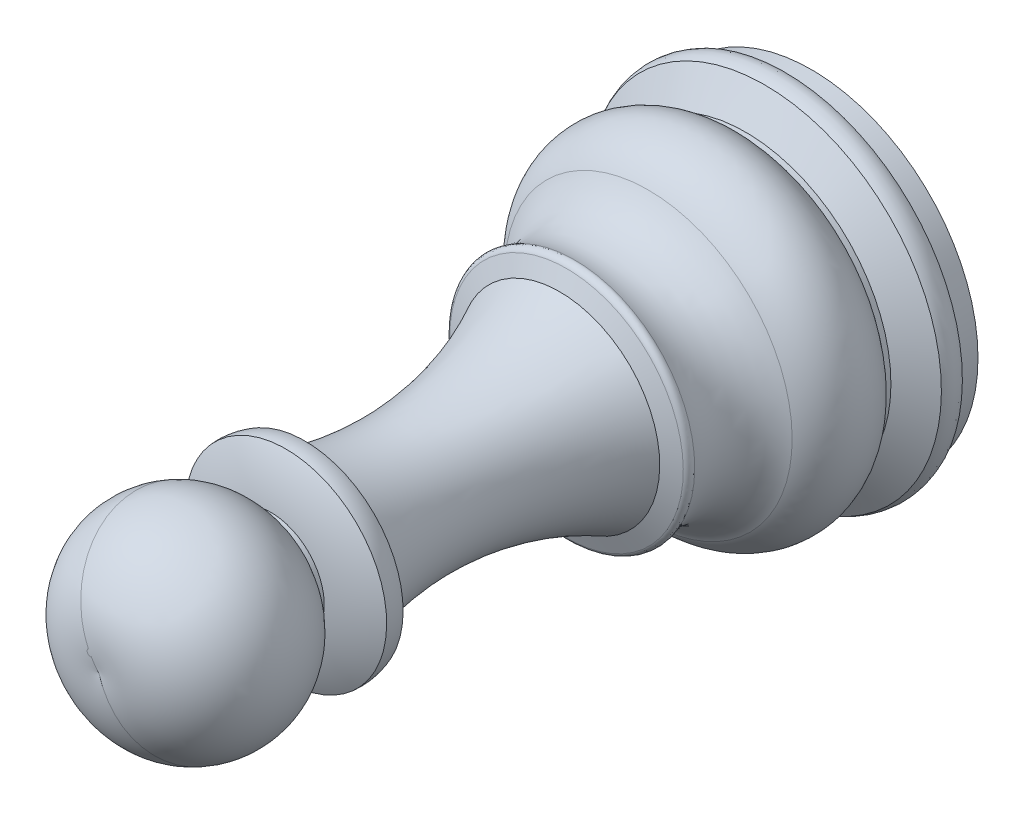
ISO-10303-21;
HEADER;
FILE_DESCRIPTION(('STEP AP214'),'2;1');
FILE_NAME('part.step','',(''),(''),'','','');
FILE_SCHEMA(('AUTOMOTIVE_DESIGN { 1 0 10303 214 1 1 1 1 }'));
ENDSEC;
DATA;
#1=APPLICATION_CONTEXT('core data for automotive mechanical design processes');
#2=APPLICATION_PROTOCOL_DEFINITION('international standard','automotive_design',2000,#1);
#3=PRODUCT_CONTEXT('',#1,'mechanical');
#4=PRODUCT('Part','Part','',(#3));
#5=PRODUCT_RELATED_PRODUCT_CATEGORY('part','',(#4));
#6=PRODUCT_DEFINITION_FORMATION('','',#4);
#7=PRODUCT_DEFINITION_CONTEXT('part definition',#1,'design');
#8=PRODUCT_DEFINITION('design','',#6,#7);
#9=PRODUCT_DEFINITION_SHAPE('','',#8);
#10=(LENGTH_UNIT() NAMED_UNIT(*) SI_UNIT(.MILLI.,.METRE.));
#11=(NAMED_UNIT(*) PLANE_ANGLE_UNIT() SI_UNIT($,.RADIAN.));
#12=(NAMED_UNIT(*) SI_UNIT($,.STERADIAN.) SOLID_ANGLE_UNIT());
#13=UNCERTAINTY_MEASURE_WITH_UNIT(LENGTH_MEASURE(1.E-05),#10,'distance_accuracy_value','');
#14=(GEOMETRIC_REPRESENTATION_CONTEXT(3) GLOBAL_UNCERTAINTY_ASSIGNED_CONTEXT((#13)) GLOBAL_UNIT_ASSIGNED_CONTEXT((#10,
#11,#12)) REPRESENTATION_CONTEXT('',''));
#15=CARTESIAN_POINT('',(0.,0.,0.));
#16=DIRECTION('',(0.,0.,1.));
#17=DIRECTION('',(1.,0.,0.));
#18=AXIS2_PLACEMENT_3D('',#15,#16,#17);
#19=CARTESIAN_POINT('',(0.,0.,1.042130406));
#20=DIRECTION('',(0.,0.,1.));
#21=DIRECTION('',(1.,0.,0.));
#22=AXIS2_PLACEMENT_3D('',#19,#20,#21);
#23=PLANE('',#22);
#24=CARTESIAN_POINT('',(0.,0.,1.0421304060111));
#25=DIRECTION('',(0.,0.,1.));
#26=DIRECTION('',(1.,0.,0.));
#27=AXIS2_PLACEMENT_3D('',#24,#25,#26);
#28=CIRCLE('',#27,6.73246072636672);
#29=CARTESIAN_POINT('',(6.73246072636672,0.,1.0421304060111));
#30=VERTEX_POINT('',#29);
#31=EDGE_CURVE('P0_E20',#30,#30,#28,.F.);
#32=ORIENTED_EDGE('',*,*,#31,.T.);
#33=EDGE_LOOP('',(#32));
#34=FACE_BOUND('',#33,.T.);
#35=ADVANCED_FACE('P0_F17',(#34),#23,.F.);
#36=CARTESIAN_POINT('',(0.,0.,1.042130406));
#37=DIRECTION('',(0.,0.,1.));
#38=DIRECTION('',(1.,0.,0.));
#39=AXIS2_PLACEMENT_3D('',#36,#37,#38);
#40=CONICAL_SURFACE('',#39,6.73246072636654,0.0163977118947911);
#41=ORIENTED_EDGE('',*,*,#31,.F.);
#42=EDGE_LOOP('',(#41));
#43=FACE_BOUND('',#42,.T.);
#44=CARTESIAN_POINT('',(0.,0.,1.84919418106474));
#45=DIRECTION('',(0.,0.,1.));
#46=DIRECTION('',(0.479425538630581,-0.877582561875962,0.));
#47=AXIS2_PLACEMENT_3D('',#44,#45,#46);
#48=CIRCLE('',#47,6.74569591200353);
#49=CARTESIAN_POINT('',(3.2340588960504,-5.91990510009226,1.84919418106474));
#50=VERTEX_POINT('',#49);
#51=EDGE_CURVE('P0_E175',#50,#50,#48,.F.);
#52=ORIENTED_EDGE('',*,*,#51,.T.);
#53=EDGE_LOOP('',(#52));
#54=FACE_BOUND('',#53,.T.);
#55=ADVANCED_FACE('P0_F183',(#43,#54),#40,.T.);
#56=CARTESIAN_POINT('',(0.,0.,1.849194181));
#57=DIRECTION('',(0.,0.,1.));
#58=DIRECTION('',(1.,0.,0.));
#59=AXIS2_PLACEMENT_3D('',#56,#57,#58);
#60=CONICAL_SURFACE('',#59,6.7456959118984,1.01883170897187);
#61=ORIENTED_EDGE('',*,*,#51,.F.);
#62=EDGE_LOOP('',(#61));
#63=FACE_BOUND('',#62,.T.);
#64=CARTESIAN_POINT('',(0.,0.,2.11001753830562));
#65=DIRECTION('',(0.,0.,1.));
#66=DIRECTION('',(0.47942553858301,-0.877582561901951,0.));
#67=AXIS2_PLACEMENT_3D('',#64,#65,#66);
#68=CIRCLE('',#67,7.16923999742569);
#69=CARTESIAN_POINT('',(3.43711674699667,-6.29160000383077,2.11001753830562));
#70=VERTEX_POINT('',#69);
#71=EDGE_CURVE('P0_E170',#70,#70,#68,.F.);
#72=ORIENTED_EDGE('',*,*,#71,.T.);
#73=EDGE_LOOP('',(#72));
#74=FACE_BOUND('',#73,.T.);
#75=ADVANCED_FACE('P0_F164',(#63,#74),#60,.T.);
#76=CARTESIAN_POINT('',(3.43711674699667,-6.29160000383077,2.11001753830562));
#77=CARTESIAN_POINT('',(3.6733071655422,-6.72394366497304,3.15481425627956));
#78=CARTESIAN_POINT('',(3.24331768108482,-5.93685319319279,3.88275983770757));
#79=CARTESIAN_POINT('',(2.80171940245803,-5.12851296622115,3.18570591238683));
#80=CARTESIAN_POINT('',(2.36012112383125,-4.32017273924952,2.4886519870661));
#81=CARTESIAN_POINT('',(2.57915717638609,-4.72111554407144,1.42772069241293));
#82=CARTESIAN_POINT('',(3.12538993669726,-5.72098790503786,1.6179630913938));
#83=(BOUNDED_CURVE() B_SPLINE_CURVE(3,(#76,#77,#78,#79,#80,#81,#82),.UNSPECIFIED.,.F.,
.F.) B_SPLINE_CURVE_WITH_KNOTS((4,3,4),(0.,0.5,1.),
.UNSPECIFIED.) CURVE() GEOMETRIC_REPRESENTATION_ITEM() RATIONAL_B_SPLINE_CURVE((1.,
0.492568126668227,0.492568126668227,1.,0.492568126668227,0.492568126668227,1.)) REPRESENTATION_ITEM(''));
#84=CARTESIAN_POINT('',(0.,0.,2.484864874));
#85=DIRECTION('',(0.,0.,1.));
#86=AXIS1_PLACEMENT('',#84,#85);
#87=SURFACE_OF_REVOLUTION('',#83,#86);
#88=ORIENTED_EDGE('',*,*,#71,.F.);
#89=EDGE_LOOP('',(#88));
#90=FACE_BOUND('',#89,.T.);
#91=CARTESIAN_POINT('',(0.,0.,2.92471433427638));
#92=DIRECTION('',(0.,0.,1.));
#93=DIRECTION('',(0.479425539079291,-0.877582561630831,0.));
#94=AXIS2_PLACEMENT_3D('',#91,#92,#93);
#95=CIRCLE('',#94,7.13520336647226);
#96=CARTESIAN_POINT('',(3.42079872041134,-6.26173004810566,2.92471433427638));
#97=VERTEX_POINT('',#96);
#98=EDGE_CURVE('P0_E146',#97,#97,#95,.F.);
#99=ORIENTED_EDGE('',*,*,#98,.T.);
#100=EDGE_LOOP('',(#99));
#101=FACE_BOUND('',#100,.T.);
#102=ADVANCED_FACE('P0_F160',(#90,#101),#87,.T.);
#103=CARTESIAN_POINT('',(2.81703470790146,-5.15654743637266,3.70546532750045));
#104=CARTESIAN_POINT('',(3.01723186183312,-5.52300586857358,3.44166822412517));
#105=CARTESIAN_POINT('',(3.21849132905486,-5.89140885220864,3.1814116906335));
#106=CARTESIAN_POINT('',(3.42079871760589,-6.26173004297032,2.92471433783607));
#107=(BOUNDED_CURVE() B_SPLINE_CURVE(3,(#103,#104,#105,#106),.UNSPECIFIED.,.F.,
.F.) B_SPLINE_CURVE_WITH_KNOTS((4,4),(0.,1.),
.UNSPECIFIED.) CURVE() GEOMETRIC_REPRESENTATION_ITEM() RATIONAL_B_SPLINE_CURVE((1.,
0.999976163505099,0.999976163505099,1.)) REPRESENTATION_ITEM(''));
#108=CARTESIAN_POINT('',(0.,0.,77.7750141));
#109=DIRECTION('',(0.,0.,1.));
#110=AXIS1_PLACEMENT('',#108,#109);
#111=SURFACE_OF_REVOLUTION('',#107,#110);
#112=ORIENTED_EDGE('',*,*,#98,.F.);
#113=EDGE_LOOP('',(#112));
#114=FACE_BOUND('',#113,.T.);
#115=CARTESIAN_POINT('',(0.,0.,3.705465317));
#116=DIRECTION('',(0.,0.,1.));
#117=DIRECTION('',(0.479425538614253,-0.877582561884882,0.));
#118=AXIS2_PLACEMENT_3D('',#115,#116,#117);
#119=CIRCLE('',#118,5.87585449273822);
#120=CARTESIAN_POINT('',(2.817034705,-5.156547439,3.705465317));
#121=VERTEX_POINT('',#120);
#122=EDGE_CURVE('P0_E143',#121,#121,#119,.F.);
#123=ORIENTED_EDGE('',*,*,#122,.T.);
#124=EDGE_LOOP('',(#123));
#125=FACE_BOUND('',#124,.T.);
#126=ADVANCED_FACE('P0_F156',(#114,#125),#111,.F.);
#127=CARTESIAN_POINT('',(0.,0.,3.705465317));
#128=DIRECTION('',(0.,0.,1.));
#129=DIRECTION('',(1.,0.,0.));
#130=AXIS2_PLACEMENT_3D('',#127,#128,#129);
#131=CYLINDRICAL_SURFACE('',#130,5.87585449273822);
#132=ORIENTED_EDGE('',*,*,#122,.F.);
#133=EDGE_LOOP('',(#132));
#134=FACE_BOUND('',#133,.T.);
#135=CARTESIAN_POINT('',(0.,0.,3.93176984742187));
#136=DIRECTION('',(0.,0.,1.));
#137=DIRECTION('',(0.479425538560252,-0.877582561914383,0.));
#138=AXIS2_PLACEMENT_3D('',#135,#136,#137);
#139=CIRCLE('',#138,5.87585449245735);
#140=CARTESIAN_POINT('',(2.81703470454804,-5.15654743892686,3.93176984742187));
#141=VERTEX_POINT('',#140);
#142=EDGE_CURVE('P0_E133',#141,#141,#139,.F.);
#143=ORIENTED_EDGE('',*,*,#142,.T.);
#144=EDGE_LOOP('',(#143));
#145=FACE_BOUND('',#144,.T.);
#146=ADVANCED_FACE('P0_F159',(#134,#145),#131,.T.);
#147=CARTESIAN_POINT('',(2.81703470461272,-5.15654743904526,3.93176984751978));
#148=CARTESIAN_POINT('',(3.62708350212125,-6.63933181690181,5.1579356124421));
#149=CARTESIAN_POINT('',(3.47942602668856,-6.36904662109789,7.22274897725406));
#150=CARTESIAN_POINT('',(2.5330854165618,-4.63678175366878,7.90246136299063));
#151=CARTESIAN_POINT('',(1.58674480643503,-2.90451688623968,8.58217374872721));
#152=CARTESIAN_POINT('',(0.860904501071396,-1.5758751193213,7.14475315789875));
#153=CARTESIAN_POINT('',(1.13727502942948,-2.08176797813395,5.13826298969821));
#154=(BOUNDED_CURVE() B_SPLINE_CURVE(3,(#147,#148,#149,#150,#151,#152,#153),.UNSPECIFIED.,.F.,
.F.) B_SPLINE_CURVE_WITH_KNOTS((4,3,4),(0.,0.5,1.),
.UNSPECIFIED.) CURVE() GEOMETRIC_REPRESENTATION_ITEM() RATIONAL_B_SPLINE_CURVE((1.,
0.641008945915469,0.641008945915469,1.,0.641008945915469,0.641008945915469,1.)) REPRESENTATION_ITEM(''));
#155=CARTESIAN_POINT('',(0.,0.,5.763057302));
#156=DIRECTION('',(0.,0.,1.));
#157=AXIS1_PLACEMENT('',#155,#156);
#158=SURFACE_OF_REVOLUTION('',#154,#157);
#159=ORIENTED_EDGE('',*,*,#142,.F.);
#160=EDGE_LOOP('',(#159));
#161=FACE_BOUND('',#160,.T.);
#162=CARTESIAN_POINT('',(0.,0.,7.63687524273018));
#163=DIRECTION('',(0.,0.,1.));
#164=DIRECTION('',(0.479425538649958,-0.877582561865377,0.));
#165=AXIS2_PLACEMENT_3D('',#162,#163,#164);
#166=CIRCLE('',#165,5.8151831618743);
#167=CARTESIAN_POINT('',(2.78794731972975,-5.10330333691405,7.63687524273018));
#168=VERTEX_POINT('',#167);
#169=EDGE_CURVE('P0_E128',#168,#168,#166,.F.);
#170=ORIENTED_EDGE('',*,*,#169,.T.);
#171=EDGE_LOOP('',(#170));
#172=FACE_BOUND('',#171,.T.);
#173=ADVANCED_FACE('P0_F120',(#161,#172),#158,.T.);
#174=CARTESIAN_POINT('',(2.32672144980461,-4.25903504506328,10.6125273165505));
#175=CARTESIAN_POINT('',(2.0932900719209,-3.83174177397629,9.46622002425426));
#176=CARTESIAN_POINT('',(2.27697022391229,-4.16796603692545,8.2811862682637));
#177=CARTESIAN_POINT('',(2.78794731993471,-5.10330333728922,7.63687524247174));
#178=(BOUNDED_CURVE() B_SPLINE_CURVE(3,(#174,#175,#176,#177),.UNSPECIFIED.,.F.,
.F.) B_SPLINE_CURVE_WITH_KNOTS((4,4),(0.,1.),
.UNSPECIFIED.) CURVE() GEOMETRIC_REPRESENTATION_ITEM() RATIONAL_B_SPLINE_CURVE((1.,
0.837009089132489,0.837009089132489,1.)) REPRESENTATION_ITEM(''));
#179=CARTESIAN_POINT('',(0.,0.,9.679423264));
#180=DIRECTION('',(0.,0.,1.));
#181=AXIS1_PLACEMENT('',#179,#180);
#182=SURFACE_OF_REVOLUTION('',#178,#181);
#183=ORIENTED_EDGE('',*,*,#169,.F.);
#184=EDGE_LOOP('',(#183));
#185=FACE_BOUND('',#184,.T.);
#186=CARTESIAN_POINT('',(0.,0.,10.612527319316));
#187=DIRECTION('',(0.,0.,1.));
#188=DIRECTION('',(0.479425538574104,-0.877582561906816,0.));
#189=AXIS2_PLACEMENT_3D('',#186,#187,#188);
#190=CIRCLE('',#189,4.85314457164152);
#191=CARTESIAN_POINT('',(2.32672145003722,-4.25903504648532,10.612527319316));
#192=VERTEX_POINT('',#191);
#193=EDGE_CURVE('P0_E104',#192,#192,#190,.F.);
#194=ORIENTED_EDGE('',*,*,#193,.T.);
#195=EDGE_LOOP('',(#194));
#196=FACE_BOUND('',#195,.T.);
#197=ADVANCED_FACE('P0_F116',(#185,#196),#182,.F.);
#198=CARTESIAN_POINT('',(2.32672144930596,-4.25903504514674,10.612527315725));
#199=CARTESIAN_POINT('',(2.35438775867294,-4.30967788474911,10.7483877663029));
#200=CARTESIAN_POINT('',(2.32756626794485,-4.26058147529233,10.88498327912));
#201=CARTESIAN_POINT('',(2.26215841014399,-4.140853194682,10.941331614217));
#202=(BOUNDED_CURVE() B_SPLINE_CURVE(3,(#198,#199,#200,#201),.UNSPECIFIED.,.F.,
.F.) B_SPLINE_CURVE_WITH_KNOTS((4,4),(0.,1.),
.UNSPECIFIED.) CURVE() GEOMETRIC_REPRESENTATION_ITEM() RATIONAL_B_SPLINE_CURVE((1.,
0.802379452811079,0.802379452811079,1.)) REPRESENTATION_ITEM(''));
#203=CARTESIAN_POINT('',(0.,0.,10.71026444));
#204=DIRECTION('',(0.,0.,1.));
#205=AXIS1_PLACEMENT('',#203,#204);
#206=SURFACE_OF_REVOLUTION('',#202,#205);
#207=ORIENTED_EDGE('',*,*,#193,.F.);
#208=EDGE_LOOP('',(#207));
#209=FACE_BOUND('',#208,.T.);
#210=CARTESIAN_POINT('',(0.,0.,10.9413316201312));
#211=DIRECTION('',(0.,0.,-1.));
#212=DIRECTION('',(-0.479425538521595,0.877582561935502,0.));
#213=AXIS2_PLACEMENT_3D('',#210,#211,#212);
#214=CIRCLE('',#213,4.71847706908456);
#215=CARTESIAN_POINT('',(-2.26215840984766,4.14085319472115,10.9413316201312));
#216=VERTEX_POINT('',#215);
#217=EDGE_CURVE('P0_E101',#216,#216,#214,.T.);
#218=ORIENTED_EDGE('',*,*,#217,.T.);
#219=EDGE_LOOP('',(#218));
#220=FACE_BOUND('',#219,.T.);
#221=ADVANCED_FACE('P0_F113',(#209,#220),#206,.T.);
#222=CARTESIAN_POINT('',(0.,0.,11.21964332));
#223=DIRECTION('',(0.,0.,-1.));
#224=DIRECTION('',(-1.,0.,0.));
#225=AXIS2_PLACEMENT_3D('',#222,#223,#224);
#226=CONICAL_SURFACE('',#225,4.04463341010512,1.17911544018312);
#227=CARTESIAN_POINT('',(0.,0.,11.2196433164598));
#228=DIRECTION('',(0.,0.,1.));
#229=DIRECTION('',(0.479425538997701,-0.877582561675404,0.));
#230=AXIS2_PLACEMENT_3D('',#227,#228,#229);
#231=CIRCLE('',#230,4.04463340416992);
#232=CARTESIAN_POINT('',(1.93910054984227,-3.54949974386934,11.2196433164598));
#233=VERTEX_POINT('',#232);
#234=EDGE_CURVE('P0_E60',#233,#233,#231,.F.);
#235=ORIENTED_EDGE('',*,*,#234,.T.);
#236=EDGE_LOOP('',(#235));
#237=FACE_BOUND('',#236,.T.);
#238=ORIENTED_EDGE('',*,*,#217,.F.);
#239=EDGE_LOOP('',(#238));
#240=FACE_BOUND('',#239,.T.);
#241=ADVANCED_FACE('P0_F89',(#237,#240),#226,.T.);
#242=CARTESIAN_POINT('',(1.52103607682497,-2.78423785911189,21.4667481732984));
#243=CARTESIAN_POINT('',(0.998183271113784,-1.82716221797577,18.0250075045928));
#244=CARTESIAN_POINT('',(1.14495076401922,-2.095818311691,14.4276152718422));
#245=CARTESIAN_POINT('',(1.93910055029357,-3.54949974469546,11.2196433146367));
#246=(BOUNDED_CURVE() B_SPLINE_CURVE(3,(#242,#243,#244,#245),.UNSPECIFIED.,.F.,
.F.) B_SPLINE_CURVE_WITH_KNOTS((4,4),(0.,1.),
.UNSPECIFIED.) CURVE() GEOMETRIC_REPRESENTATION_ITEM() RATIONAL_B_SPLINE_CURVE((1.,
0.949493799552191,0.949493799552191,1.)) REPRESENTATION_ITEM(''));
#247=CARTESIAN_POINT('',(0.,0.,17.39862594));
#248=DIRECTION('',(0.,0.,1.));
#249=AXIS1_PLACEMENT('',#247,#248);
#250=SURFACE_OF_REVOLUTION('',#246,#249);
#251=ORIENTED_EDGE('',*,*,#234,.F.);
#252=EDGE_LOOP('',(#251));
#253=FACE_BOUND('',#252,.T.);
#254=CARTESIAN_POINT('',(0.,0.,21.4667481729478));
#255=DIRECTION('',(0.,0.,1.));
#256=DIRECTION('',(-0.479425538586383,0.877582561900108,0.));
#257=AXIS2_PLACEMENT_3D('',#254,#255,#256);
#258=CIRCLE('',#257,3.17262213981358);
#259=CARTESIAN_POINT('',(1.52103607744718,-2.78423786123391,21.4667481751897));
#260=VERTEX_POINT('',#259);
#261=CARTESIAN_POINT('',(-1.52103607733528,2.7842378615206,21.4667481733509));
#262=VERTEX_POINT('',#261);
#263=EDGE_CURVE('P0_E52',#260,#262,#258,.F.);
#264=ORIENTED_EDGE('',*,*,#263,.T.);
#265=CARTESIAN_POINT('',(0.,0.,21.4667481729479));
#266=DIRECTION('',(0.,0.,1.));
#267=DIRECTION('',(0.479425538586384,-0.877582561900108,0.));
#268=AXIS2_PLACEMENT_3D('',#265,#266,#267);
#269=CIRCLE('',#268,3.17262213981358);
#270=EDGE_CURVE('P0_E58',#262,#260,#269,.F.);
#271=ORIENTED_EDGE('',*,*,#270,.T.);
#272=EDGE_LOOP('',(#264,#271));
#273=FACE_BOUND('',#272,.T.);
#274=ADVANCED_FACE('P0_F57',(#253,#273),#250,.F.);
#275=CARTESIAN_POINT('',(-1.52103607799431,2.78423786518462,21.466748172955));
#276=CARTESIAN_POINT('',(-1.64819144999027,3.01699421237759,21.4589694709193));
#277=CARTESIAN_POINT('',(-1.77517769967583,3.24944098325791,21.4747017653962));
#278=CARTESIAN_POINT('',(-1.90099759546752,3.4797527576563,21.5138215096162));
#279=(BOUNDED_CURVE() B_SPLINE_CURVE(3,(#275,#276,#277,#278),.UNSPECIFIED.,.F.,
.F.) B_SPLINE_CURVE_WITH_KNOTS((4,4),(0.,1.),
.UNSPECIFIED.) CURVE() GEOMETRIC_REPRESENTATION_ITEM() RATIONAL_B_SPLINE_CURVE((1.,
0.997382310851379,0.997382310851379,1.)) REPRESENTATION_ITEM(''));
#280=CARTESIAN_POINT('',(0.,0.,25.94876561));
#281=DIRECTION('',(0.,0.,1.));
#282=AXIS1_PLACEMENT('',#280,#281);
#283=SURFACE_OF_REVOLUTION('',#279,#282);
#284=CARTESIAN_POINT('',(-1.584057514,2.89959783,25.94876561));
#285=DIRECTION('',(-0.877582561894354,-0.479425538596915,0.));
#286=DIRECTION('',(0.479425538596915,-0.877582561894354,0.));
#287=AXIS2_PLACEMENT_3D('',#284,#285,#286);
#288=CIRCLE('',#287,4.48394468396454);
#289=CARTESIAN_POINT('',(-1.90099759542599,3.47975275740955,21.5138215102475));
#290=VERTEX_POINT('',#289);
#291=EDGE_CURVE('P0_E59',#290,#262,#288,.T.);
#292=ORIENTED_EDGE('',*,*,#291,.T.);
#293=ORIENTED_EDGE('',*,*,#263,.F.);
#294=CARTESIAN_POINT('',(1.584057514,-2.89959783,25.94876561));
#295=DIRECTION('',(-0.877582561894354,-0.479425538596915,0.));
#296=DIRECTION('',(0.479425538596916,-0.877582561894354,0.));
#297=AXIS2_PLACEMENT_3D('',#294,#295,#296);
#298=CIRCLE('',#297,4.48394468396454);
#299=CARTESIAN_POINT('',(1.90099759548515,-3.47975275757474,21.5138215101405));
#300=VERTEX_POINT('',#299);
#301=EDGE_CURVE('P0_E66',#260,#300,#298,.T.);
#302=ORIENTED_EDGE('',*,*,#301,.T.);
#303=CARTESIAN_POINT('',(0.,0.,21.5138215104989));
#304=DIRECTION('',(0.,0.,1.));
#305=DIRECTION('',(-0.479425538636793,0.877582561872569,0.));
#306=AXIS2_PLACEMENT_3D('',#303,#304,#305);
#307=CIRCLE('',#306,3.96515713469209);
#308=EDGE_CURVE('P0_E69',#300,#290,#307,.F.);
#309=ORIENTED_EDGE('',*,*,#308,.T.);
#310=EDGE_LOOP('',(#292,#293,#302,#309));
#311=FACE_BOUND('',#310,.T.);
#312=ADVANCED_FACE('P0_F68',(#311),#283,.T.);
#313=CARTESIAN_POINT('',(1.52103607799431,-2.78423786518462,21.466748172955));
#314=CARTESIAN_POINT('',(5.46490652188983,-10.0034442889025,21.225482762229));
#315=CARTESIAN_POINT('',(5.75520975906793,-10.5348408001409,29.4329553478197));
#316=CARTESIAN_POINT('',(1.83706527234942,-3.36272542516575,30.401546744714));
#317=CARTESIAN_POINT('',(-2.08107921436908,3.80938994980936,31.3701381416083));
#318=CARTESIAN_POINT('',(-2.71859875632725,4.97636164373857,23.2484997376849));
#319=CARTESIAN_POINT('',(1.14305032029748,-2.09233957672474,21.5601887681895));
#320=(BOUNDED_CURVE() B_SPLINE_CURVE(3,(#313,#314,#315,#316,#317,#318,#319),.UNSPECIFIED.,.F.,
.F.) B_SPLINE_CURVE_WITH_KNOTS((4,3,4),(0.,0.5,1.),
.UNSPECIFIED.) CURVE() GEOMETRIC_REPRESENTATION_ITEM() RATIONAL_B_SPLINE_CURVE((1.,
0.362872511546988,0.362872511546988,1.,0.362872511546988,0.362872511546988,1.)) REPRESENTATION_ITEM(''));
#321=CARTESIAN_POINT('',(0.,0.,25.94876561));
#322=DIRECTION('',(0.,0.,1.));
#323=AXIS1_PLACEMENT('',#321,#322);
#324=SURFACE_OF_REVOLUTION('',#320,#323);
#325=ORIENTED_EDGE('',*,*,#270,.F.);
#326=ORIENTED_EDGE('',*,*,#291,.F.);
#327=CARTESIAN_POINT('',(0.,0.,21.5138215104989));
#328=DIRECTION('',(0.,0.,1.));
#329=DIRECTION('',(0.479425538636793,-0.877582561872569,0.));
#330=AXIS2_PLACEMENT_3D('',#327,#328,#329);
#331=CIRCLE('',#330,3.96515713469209);
#332=EDGE_CURVE('P0_E246',#290,#300,#331,.F.);
#333=ORIENTED_EDGE('',*,*,#332,.T.);
#334=ORIENTED_EDGE('',*,*,#301,.F.);
#335=EDGE_LOOP('',(#325,#326,#333,#334));
#336=FACE_BOUND('',#335,.T.);
#337=ADVANCED_FACE('P0_F63',(#336),#324,.T.);
#338=CARTESIAN_POINT('',(1.90099759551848,-3.47975275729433,21.5138215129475));
#339=CARTESIAN_POINT('',(2.38573265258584,-4.36705432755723,24.2162739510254));
#340=CARTESIAN_POINT('',(1.15154357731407,-2.10788637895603,25.5195232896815));
#341=CARTESIAN_POINT('',(0.39429547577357,-0.721753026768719,23.1048326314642));
#342=CARTESIAN_POINT('',(-0.362952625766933,0.664380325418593,20.6901419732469));
#343=CARTESIAN_POINT('',(0.704033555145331,-1.28872477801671,18.8537209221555));
#344=CARTESIAN_POINT('',(1.69687574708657,-3.1061102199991,20.8629237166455));
#345=(BOUNDED_CURVE() B_SPLINE_CURVE(3,(#338,#339,#340,#341,#342,#343,#344),.UNSPECIFIED.,.F.,
.F.) B_SPLINE_CURVE_WITH_KNOTS((4,3,4),(0.,0.5,1.),
.UNSPECIFIED.) CURVE() GEOMETRIC_REPRESENTATION_ITEM() RATIONAL_B_SPLINE_CURVE((1.,
0.406934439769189,0.406934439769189,1.,0.40693443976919,0.40693443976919,1.)) REPRESENTATION_ITEM(''));
#346=CARTESIAN_POINT('',(0.,0.,22.1347791));
#347=DIRECTION('',(0.,0.,1.));
#348=AXIS1_PLACEMENT('',#346,#347);
#349=SURFACE_OF_REVOLUTION('',#345,#348);
#350=ORIENTED_EDGE('',*,*,#332,.F.);
#351=ORIENTED_EDGE('',*,*,#308,.F.);
#352=EDGE_LOOP('',(#350,#351));
#353=FACE_BOUND('',#352,.T.);
#354=CARTESIAN_POINT('',(0.,0.,22.2843402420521));
#355=DIRECTION('',(0.,0.,1.));
#356=DIRECTION('',(0.479425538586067,-0.87758256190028,0.));
#357=AXIS2_PLACEMENT_3D('',#354,#355,#356);
#358=CIRCLE('',#357,4.07119157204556);
#359=CARTESIAN_POINT('',(1.951833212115,-3.57280672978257,22.2843402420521));
#360=VERTEX_POINT('',#359);
#361=EDGE_CURVE('P0_E226',#360,#360,#358,.F.);
#362=ORIENTED_EDGE('',*,*,#361,.T.);
#363=EDGE_LOOP('',(#362));
#364=FACE_BOUND('',#363,.T.);
#365=ADVANCED_FACE('P0_F238',(#353,#364),#349,.T.);
#366=CARTESIAN_POINT('',(1.95183321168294,-3.57280672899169,22.2843402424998));
#367=CARTESIAN_POINT('',(1.66208260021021,-3.04242179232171,22.5845577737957));
#368=CARTESIAN_POINT('',(1.35371864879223,-2.47796536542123,22.7887507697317));
#369=CARTESIAN_POINT('',(1.034005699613,-1.89273473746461,22.8921089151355));
#370=(BOUNDED_CURVE() B_SPLINE_CURVE(3,(#366,#367,#368,#369),.UNSPECIFIED.,.F.,
.F.) B_SPLINE_CURVE_WITH_KNOTS((4,4),(0.,1.),
.UNSPECIFIED.) CURVE() GEOMETRIC_REPRESENTATION_ITEM() RATIONAL_B_SPLINE_CURVE((1.,
0.992147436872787,0.992147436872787,1.)) REPRESENTATION_ITEM(''));
#371=CARTESIAN_POINT('',(0.,0.,16.40691685));
#372=DIRECTION('',(0.,0.,1.));
#373=AXIS1_PLACEMENT('',#371,#372);
#374=SURFACE_OF_REVOLUTION('',#370,#373);
#375=ORIENTED_EDGE('',*,*,#361,.F.);
#376=EDGE_LOOP('',(#375));
#377=FACE_BOUND('',#376,.T.);
#378=CARTESIAN_POINT('',(0.,0.,22.89210892));
#379=DIRECTION('',(0.,0.,1.));
#380=DIRECTION('',(0.47942553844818,-0.877582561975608,0.));
#381=AXIS2_PLACEMENT_3D('',#378,#379,#380);
#382=CIRCLE('',#381,2.15675973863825);
#383=CARTESIAN_POINT('',(1.034005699,-1.892734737,22.89210892));
#384=VERTEX_POINT('',#383);
#385=EDGE_CURVE('P0_E223',#384,#384,#382,.F.);
#386=ORIENTED_EDGE('',*,*,#385,.T.);
#387=EDGE_LOOP('',(#386));
#388=FACE_BOUND('',#387,.T.);
#389=ADVANCED_FACE('P0_F236',(#377,#388),#374,.T.);
#390=CARTESIAN_POINT('',(0.,0.,22.89210892));
#391=DIRECTION('',(0.,0.,1.));
#392=DIRECTION('',(1.,0.,0.));
#393=AXIS2_PLACEMENT_3D('',#390,#391,#392);
#394=CYLINDRICAL_SURFACE('',#393,2.15675973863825);
#395=ORIENTED_EDGE('',*,*,#385,.F.);
#396=EDGE_LOOP('',(#395));
#397=FACE_BOUND('',#396,.T.);
#398=CARTESIAN_POINT('',(0.,0.,23.1428775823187));
#399=DIRECTION('',(0.,0.,1.));
#400=DIRECTION('',(-0.479425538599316,0.877582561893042,0.));
#401=AXIS2_PLACEMENT_3D('',#398,#399,#400);
#402=CIRCLE('',#401,2.15675973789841);
#403=CARTESIAN_POINT('',(1.03400569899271,-1.89273473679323,23.1428775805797));
#404=VERTEX_POINT('',#403);
#405=CARTESIAN_POINT('',(-1.03400569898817,1.89273473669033,23.1428775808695));
#406=VERTEX_POINT('',#405);
#407=EDGE_CURVE('P0_E34',#404,#406,#402,.F.);
#408=ORIENTED_EDGE('',*,*,#407,.T.);
#409=CARTESIAN_POINT('',(0.,0.,23.1428775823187));
#410=DIRECTION('',(0.,0.,1.));
#411=DIRECTION('',(0.479425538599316,-0.877582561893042,0.));
#412=AXIS2_PLACEMENT_3D('',#409,#410,#411);
#413=CIRCLE('',#412,2.15675973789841);
#414=EDGE_CURVE('P0_E26',#406,#404,#413,.F.);
#415=ORIENTED_EDGE('',*,*,#414,.T.);
#416=EDGE_LOOP('',(#408,#415));
#417=FACE_BOUND('',#416,.T.);
#418=ADVANCED_FACE('P0_F199',(#397,#417),#394,.T.);
#419=CARTESIAN_POINT('',(-1.03400569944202,1.89273473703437,23.1428775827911));
#420=CARTESIAN_POINT('',(-3.42249918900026,6.26484274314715,25.5396093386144));
#421=CARTESIAN_POINT('',(-2.6102512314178,4.77803282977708,30.8021374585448));
#422=CARTESIAN_POINT('',(-5.48399216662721E-11,8.80781992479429E-11,29.8421669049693));
#423=(BOUNDED_CURVE() B_SPLINE_CURVE(3,(#419,#420,#421,#422),.UNSPECIFIED.,.F.,
.F.) B_SPLINE_CURVE_WITH_KNOTS((4,4),(0.,1.),
.UNSPECIFIED.) CURVE() GEOMETRIC_REPRESENTATION_ITEM() RATIONAL_B_SPLINE_CURVE((1.,
0.424339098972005,0.424339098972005,1.)) REPRESENTATION_ITEM(''));
#424=CARTESIAN_POINT('',(0.,0.,26.34392301));
#425=DIRECTION('',(0.,0.,1.));
#426=AXIS1_PLACEMENT('',#424,#425);
#427=SURFACE_OF_REVOLUTION('',#423,#426);
#428=ORIENTED_EDGE('',*,*,#407,.F.);
#429=CARTESIAN_POINT('',(0.295711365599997,-0.541296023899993,26.34392301));
#430=DIRECTION('',(-0.877582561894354,-0.479425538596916,0.));
#431=DIRECTION('',(0.479425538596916,-0.877582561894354,0.));
#432=AXIS2_PLACEMENT_3D('',#429,#430,#431);
#433=CIRCLE('',#432,3.55220451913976);
#434=CARTESIAN_POINT('',(5.42019771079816E-13,2.95607722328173E-13,29.842166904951));
#435=VERTEX_POINT('',#434);
#436=EDGE_CURVE('P0_E11',#404,#435,#433,.T.);
#437=ORIENTED_EDGE('',*,*,#436,.T.);
#438=CARTESIAN_POINT('',(-0.295711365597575,0.541296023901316,26.34392301));
#439=DIRECTION('',(-0.877582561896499,-0.479425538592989,0.));
#440=DIRECTION('',(0.47942553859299,-0.877582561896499,0.));
#441=AXIS2_PLACEMENT_3D('',#438,#439,#440);
#442=CIRCLE('',#441,3.55220451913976);
#443=EDGE_CURVE('P0_E214',#435,#406,#442,.T.);
#444=ORIENTED_EDGE('',*,*,#443,.T.);
#445=EDGE_LOOP('',(#428,#437,#444));
#446=FACE_BOUND('',#445,.T.);
#447=ADVANCED_FACE('P0_F193',(#446),#427,.T.);
#448=CARTESIAN_POINT('',(1.03400569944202,-1.89273473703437,23.1428775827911));
#449=CARTESIAN_POINT('',(2.03382934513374,-3.72289964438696,24.146149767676));
#450=CARTESIAN_POINT('',(2.32820080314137,-4.26174298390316,26.3774496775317));
#451=CARTESIAN_POINT('',(1.71522456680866,-3.13969750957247,28.3064338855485));
#452=CARTESIAN_POINT('',(1.10224833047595,-2.01765203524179,30.2354180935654));
#453=CARTESIAN_POINT('',(0.00233590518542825,-0.00427584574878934,30.5390872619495));
#454=CARTESIAN_POINT('',(-0.830134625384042,1.51955123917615,29.0091690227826));
#455=(BOUNDED_CURVE() B_SPLINE_CURVE(3,(#448,#449,#450,#451,#452,#453,#454),.UNSPECIFIED.,.F.,
.F.) B_SPLINE_CURVE_WITH_KNOTS((4,3,4),(0.,0.5,1.),
.UNSPECIFIED.) CURVE() GEOMETRIC_REPRESENTATION_ITEM() RATIONAL_B_SPLINE_CURVE((1.,
0.771382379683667,0.771382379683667,1.,0.771382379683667,0.771382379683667,1.)) REPRESENTATION_ITEM(''));
#456=CARTESIAN_POINT('',(0.,0.,26.34392301));
#457=DIRECTION('',(0.,0.,1.));
#458=AXIS1_PLACEMENT('',#456,#457);
#459=SURFACE_OF_REVOLUTION('',#455,#458);
#460=ORIENTED_EDGE('',*,*,#414,.F.);
#461=ORIENTED_EDGE('',*,*,#443,.F.);
#462=ORIENTED_EDGE('',*,*,#436,.F.);
#463=EDGE_LOOP('',(#460,#461,#462));
#464=FACE_BOUND('',#463,.T.);
#465=ADVANCED_FACE('P0_F191',(#464),#459,.T.);
#466=CLOSED_SHELL('',(#35,#55,#75,#102,#126,#146,#173,#197,#221,#241,#274,#312,#337,#365,#389,
#418,#447,#465));
#467=MANIFOLD_SOLID_BREP('P0_B1',#466);
#468=CARTESIAN_POINT('',(0.,0.,1.542130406));
#469=DIRECTION('',(0.,0.,1.));
#470=DIRECTION('',(1.,0.,0.));
#471=AXIS2_PLACEMENT_3D('',#468,#469,#470);
#472=PLANE('',#471);
#473=CARTESIAN_POINT('',(0.,0.,1.542130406));
#474=DIRECTION('',(0.,0.,1.));
#475=DIRECTION('',(1.,0.,0.));
#476=AXIS2_PLACEMENT_3D('',#473,#474,#475);
#477=CIRCLE('',#476,6.24059308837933);
#478=CARTESIAN_POINT('',(6.24059308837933,0.,1.542130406));
#479=VERTEX_POINT('',#478);
#480=EDGE_CURVE('P1_E20',#479,#479,#477,.F.);
#481=ORIENTED_EDGE('',*,*,#480,.T.);
#482=EDGE_LOOP('',(#481));
#483=FACE_BOUND('',#482,.T.);
#484=ADVANCED_FACE('P1_F17',(#483),#472,.F.);
#485=CARTESIAN_POINT('',(0.,0.,1.542130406));
#486=DIRECTION('',(0.,0.,1.));
#487=DIRECTION('',(1.,0.,0.));
#488=AXIS2_PLACEMENT_3D('',#485,#486,#487);
#489=CONICAL_SURFACE('',#488,6.24059308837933,0.0163977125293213);
#490=ORIENTED_EDGE('',*,*,#480,.F.);
#491=EDGE_LOOP('',(#490));
#492=FACE_BOUND('',#491,.T.);
#493=CARTESIAN_POINT('',(0.,0.,2.13129771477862));
#494=DIRECTION('',(0.,0.,1.));
#495=DIRECTION('',(0.479425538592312,-0.877582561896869,0.));
#496=AXIS2_PLACEMENT_3D('',#493,#494,#495);
#497=CIRCLE('',#496,6.25025495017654);
#498=CARTESIAN_POINT('',(2.99653184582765,-5.48511475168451,2.13129771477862));
#499=VERTEX_POINT('',#498);
#500=EDGE_CURVE('P1_E100',#499,#499,#497,.F.);
#501=ORIENTED_EDGE('',*,*,#500,.T.);
#502=EDGE_LOOP('',(#501));
#503=FACE_BOUND('',#502,.T.);
#504=ADVANCED_FACE('P1_F129',(#492,#503),#489,.T.);
#505=CARTESIAN_POINT('',(0.,0.,2.131297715));
#506=DIRECTION('',(0.,0.,1.));
#507=DIRECTION('',(1.,0.,0.));
#508=AXIS2_PLACEMENT_3D('',#505,#506,#507);
#509=CONICAL_SURFACE('',#508,6.25025495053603,1.01883170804);
#510=ORIENTED_EDGE('',*,*,#500,.F.);
#511=EDGE_LOOP('',(#510));
#512=FACE_BOUND('',#511,.T.);
#513=CARTESIAN_POINT('',(0.,0.,2.43931500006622));
#514=DIRECTION('',(0.,0.,1.));
#515=DIRECTION('',(-0.479425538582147,0.877582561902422,0.));
#516=AXIS2_PLACEMENT_3D('',#513,#514,#515);
#517=CIRCLE('',#516,6.75043599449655);
#518=CARTESIAN_POINT('',(3.23633141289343,-5.9240649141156,2.4393150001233));
#519=VERTEX_POINT('',#518);
#520=CARTESIAN_POINT('',(-3.23633141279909,5.92406491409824,2.43931500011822));
#521=VERTEX_POINT('',#520);
#522=EDGE_CURVE('P1_E94',#519,#521,#517,.F.);
#523=ORIENTED_EDGE('',*,*,#522,.T.);
#524=CARTESIAN_POINT('',(0.,0.,2.43931500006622));
#525=DIRECTION('',(0.,0.,1.));
#526=DIRECTION('',(0.479425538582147,-0.877582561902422,0.));
#527=AXIS2_PLACEMENT_3D('',#524,#525,#526);
#528=CIRCLE('',#527,6.75043599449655);
#529=EDGE_CURVE('P1_E92',#521,#519,#528,.F.);
#530=ORIENTED_EDGE('',*,*,#529,.T.);
#531=EDGE_LOOP('',(#523,#530));
#532=FACE_BOUND('',#531,.T.);
#533=ADVANCED_FACE('P1_F96',(#512,#532),#509,.T.);
#534=CARTESIAN_POINT('',(-3.23633141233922,5.92406491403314,2.43931500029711));
#535=CARTESIAN_POINT('',(-3.23905783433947,5.9290555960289,2.48627762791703));
#536=CARTESIAN_POINT('',(-3.2375692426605,5.92633074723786,2.53348131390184));
#537=CARTESIAN_POINT('',(-3.23191709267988,5.91598455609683,2.57929439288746));
#538=(BOUNDED_CURVE() B_SPLINE_CURVE(3,(#534,#535,#536,#537),.UNSPECIFIED.,.F.,
.F.) B_SPLINE_CURVE_WITH_KNOTS((4,4),(0.,1.),
.UNSPECIFIED.) CURVE() GEOMETRIC_REPRESENTATION_ITEM() RATIONAL_B_SPLINE_CURVE((1.,
0.988477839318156,0.988477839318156,1.)) REPRESENTATION_ITEM(''));
#539=CARTESIAN_POINT('',(0.,0.,2.484864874));
#540=DIRECTION('',(0.,0.,1.));
#541=AXIS1_PLACEMENT('',#539,#540);
#542=SURFACE_OF_REVOLUTION('',#538,#541);
#543=CARTESIAN_POINT('',(-3.055992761,5.593957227,2.484864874));
#544=DIRECTION('',(-0.877582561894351,-0.47942553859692,0.));
#545=DIRECTION('',(0.47942553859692,-0.877582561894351,0.));
#546=AXIS2_PLACEMENT_3D('',#543,#544,#545);
#547=CIRCLE('',#546,0.378903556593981);
#548=CARTESIAN_POINT('',(-3.23191709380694,5.91598455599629,2.57929439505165));
#549=VERTEX_POINT('',#548);
#550=EDGE_CURVE('P1_E99',#549,#521,#547,.T.);
#551=ORIENTED_EDGE('',*,*,#550,.T.);
#552=ORIENTED_EDGE('',*,*,#522,.F.);
#553=CARTESIAN_POINT('',(3.055992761,-5.593957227,2.484864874));
#554=DIRECTION('',(-0.877582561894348,-0.479425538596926,0.));
#555=DIRECTION('',(0.479425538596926,-0.877582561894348,0.));
#556=AXIS2_PLACEMENT_3D('',#553,#554,#555);
#557=CIRCLE('',#556,0.378903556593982);
#558=CARTESIAN_POINT('',(3.23191709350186,-5.91598455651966,2.57929439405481));
#559=VERTEX_POINT('',#558);
#560=EDGE_CURVE('P1_E112',#519,#559,#557,.T.);
#561=ORIENTED_EDGE('',*,*,#560,.T.);
#562=CARTESIAN_POINT('',(0.,0.,2.57929439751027));
#563=DIRECTION('',(0.,0.,1.));
#564=DIRECTION('',(-0.479425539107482,0.87758256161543,0.));
#565=AXIS2_PLACEMENT_3D('',#562,#563,#564);
#566=CIRCLE('',#565,6.74122847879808);
#567=EDGE_CURVE('P1_E105',#559,#549,#566,.F.);
#568=ORIENTED_EDGE('',*,*,#567,.T.);
#569=EDGE_LOOP('',(#551,#552,#561,#568));
#570=FACE_BOUND('',#569,.T.);
#571=ADVANCED_FACE('P1_F103',(#570),#542,.T.);
#572=CARTESIAN_POINT('',(3.23633141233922,-5.92406491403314,2.43931500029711));
#573=CARTESIAN_POINT('',(3.27300032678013,-5.99118691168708,3.07093716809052));
#574=CARTESIAN_POINT('',(2.97490453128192,-5.44552621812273,3.20580687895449));
#575=CARTESIAN_POINT('',(2.88281345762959,-5.27695463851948,2.59925977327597));
#576=CARTESIAN_POINT('',(2.79072238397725,-5.10838305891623,1.99271266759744));
#577=CARTESIAN_POINT('',(3.07169654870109,-5.6227028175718,1.74507333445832));
#578=CARTESIAN_POINT('',(3.21602651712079,-5.8868970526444,2.30557917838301));
#579=(BOUNDED_CURVE() B_SPLINE_CURVE(3,(#572,#573,#574,#575,#576,#577,#578),.UNSPECIFIED.,.F.,
.F.) B_SPLINE_CURVE_WITH_KNOTS((4,3,4),(0.,0.5,1.),
.UNSPECIFIED.) CURVE() GEOMETRIC_REPRESENTATION_ITEM() RATIONAL_B_SPLINE_CURVE((1.,
0.395306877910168,0.395306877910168,1.,0.395306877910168,0.395306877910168,1.)) REPRESENTATION_ITEM(''));
#580=CARTESIAN_POINT('',(0.,0.,2.484864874));
#581=DIRECTION('',(0.,0.,1.));
#582=AXIS1_PLACEMENT('',#580,#581);
#583=SURFACE_OF_REVOLUTION('',#579,#582);
#584=ORIENTED_EDGE('',*,*,#529,.F.);
#585=ORIENTED_EDGE('',*,*,#550,.F.);
#586=CARTESIAN_POINT('',(0.,0.,2.57929439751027));
#587=DIRECTION('',(0.,0.,1.));
#588=DIRECTION('',(0.479425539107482,-0.87758256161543,0.));
#589=AXIS2_PLACEMENT_3D('',#586,#587,#588);
#590=CIRCLE('',#589,6.74122847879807);
#591=EDGE_CURVE('P1_E351',#549,#559,#590,.F.);
#592=ORIENTED_EDGE('',*,*,#591,.T.);
#593=ORIENTED_EDGE('',*,*,#560,.F.);
#594=EDGE_LOOP('',(#584,#585,#592,#593));
#595=FACE_BOUND('',#594,.T.);
#596=ADVANCED_FACE('P1_F111',(#595),#583,.T.);
#597=CARTESIAN_POINT('',(-2.57732193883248,4.71775615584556,3.43042741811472));
#598=CARTESIAN_POINT('',(-73.2170124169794,134.022842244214,-90.2971337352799));
#599=CARTESIAN_POINT('',(-118.474407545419,216.865948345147,56.6158161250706));
#600=CARTESIAN_POINT('',(-48.2479256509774,88.3172354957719,151.684720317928));
#601=CARTESIAN_POINT('',(21.9785562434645,-40.2314773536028,246.753624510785));
#602=CARTESIAN_POINT('',(67.877132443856,-124.248257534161,100.708671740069));
#603=CARTESIAN_POINT('',(-1.93028676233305,3.53336620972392,4.3063494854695));
#604=(BOUNDED_CURVE() B_SPLINE_CURVE(3,(#597,#598,#599,#600,#601,#602,#603),.UNSPECIFIED.,.F.,
.F.) B_SPLINE_CURVE_WITH_KNOTS((4,3,4),(0.,0.5,1.),
.UNSPECIFIED.) CURVE() GEOMETRIC_REPRESENTATION_ITEM() RATIONAL_B_SPLINE_CURVE((1.,
0.336376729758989,0.336376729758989,1.,0.336376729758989,0.336376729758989,1.)) REPRESENTATION_ITEM(''));
#605=CARTESIAN_POINT('',(0.,0.,77.7750141));
#606=DIRECTION('',(0.,0.,1.));
#607=AXIS1_PLACEMENT('',#605,#606);
#608=SURFACE_OF_REVOLUTION('',#604,#607);
#609=CARTESIAN_POINT('',(-25.2503857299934,46.2205210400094,77.7750141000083));
#610=DIRECTION('',(-0.877582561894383,-0.479425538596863,1.00324504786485E-13));
#611=DIRECTION('',(0.479425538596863,-0.877582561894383,0.));
#612=AXIS2_PLACEMENT_3D('',#609,#610,#611);
#613=CIRCLE('',#612,88.11166145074);
#614=CARTESIAN_POINT('',(-2.5773219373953,4.71775615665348,3.4304274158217));
#615=VERTEX_POINT('',#614);
#616=EDGE_CURVE('P1_E341',#615,#549,#613,.F.);
#617=ORIENTED_EDGE('',*,*,#616,.T.);
#618=ORIENTED_EDGE('',*,*,#567,.F.);
#619=CARTESIAN_POINT('',(25.2503857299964,-46.2205210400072,77.7750141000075));
#620=DIRECTION('',(-0.877582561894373,-0.47942553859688,0.));
#621=DIRECTION('',(0.47942553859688,-0.877582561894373,0.));
#622=AXIS2_PLACEMENT_3D('',#619,#620,#621);
#623=CIRCLE('',#622,88.1116614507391);
#624=CARTESIAN_POINT('',(2.57732193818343,-4.71775615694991,3.43042741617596));
#625=VERTEX_POINT('',#624);
#626=EDGE_CURVE('P1_E320',#559,#625,#623,.F.);
#627=ORIENTED_EDGE('',*,*,#626,.T.);
#628=CARTESIAN_POINT('',(0.,0.,3.430427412));
#629=DIRECTION('',(0.,0.,1.));
#630=DIRECTION('',(-0.479425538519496,0.877582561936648,0.));
#631=AXIS2_PLACEMENT_3D('',#628,#629,#630);
#632=CIRCLE('',#631,5.37585449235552);
#633=EDGE_CURVE('P1_E311',#625,#615,#632,.F.);
#634=ORIENTED_EDGE('',*,*,#633,.T.);
#635=EDGE_LOOP('',(#617,#618,#627,#634));
#636=FACE_BOUND('',#635,.T.);
#637=ADVANCED_FACE('P1_F331',(#636),#608,.F.);
#638=CARTESIAN_POINT('',(2.57732193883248,-4.71775615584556,3.43042741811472));
#639=CARTESIAN_POINT('',(2.79427539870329,-5.11488680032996,3.14256490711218));
#640=CARTESIAN_POINT('',(3.01247984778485,-5.51430736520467,2.85884601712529));
#641=CARTESIAN_POINT('',(3.23191709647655,-5.91598455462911,2.57929439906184));
#642=(BOUNDED_CURVE() B_SPLINE_CURVE(3,(#638,#639,#640,#641),.UNSPECIFIED.,.F.,
.F.) B_SPLINE_CURVE_WITH_KNOTS((4,4),(0.,1.),
.UNSPECIFIED.) CURVE() GEOMETRIC_REPRESENTATION_ITEM() RATIONAL_B_SPLINE_CURVE((1.,
0.999972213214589,0.999972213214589,1.)) REPRESENTATION_ITEM(''));
#643=CARTESIAN_POINT('',(0.,0.,77.7750141));
#644=DIRECTION('',(0.,0.,1.));
#645=AXIS1_PLACEMENT('',#643,#644);
#646=SURFACE_OF_REVOLUTION('',#642,#645);
#647=ORIENTED_EDGE('',*,*,#591,.F.);
#648=ORIENTED_EDGE('',*,*,#616,.F.);
#649=CARTESIAN_POINT('',(0.,0.,3.430427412));
#650=DIRECTION('',(0.,0.,1.));
#651=DIRECTION('',(0.479425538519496,-0.877582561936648,0.));
#652=AXIS2_PLACEMENT_3D('',#649,#650,#651);
#653=CIRCLE('',#652,5.37585449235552);
#654=EDGE_CURVE('P1_E303',#615,#625,#653,.F.);
#655=ORIENTED_EDGE('',*,*,#654,.T.);
#656=ORIENTED_EDGE('',*,*,#626,.F.);
#657=EDGE_LOOP('',(#647,#648,#655,#656));
#658=FACE_BOUND('',#657,.T.);
#659=ADVANCED_FACE('P1_F329',(#658),#646,.F.);
#660=CARTESIAN_POINT('',(-0.794292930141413,1.45394345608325,23.4743510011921));
#661=CARTESIAN_POINT('',(-3.19303764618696,5.84481620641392,25.2876139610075));
#662=CARTESIAN_POINT('',(-2.49877110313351,4.57396982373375,30.408610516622));
#663=CARTESIAN_POINT('',(-2.40668487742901E-11,3.17484753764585E-11,29.3331546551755));
#664=(BOUNDED_CURVE() B_SPLINE_CURVE(3,(#660,#661,#662,#663),.UNSPECIFIED.,.F.,
.F.) B_SPLINE_CURVE_WITH_KNOTS((4,4),(0.,1.),
.UNSPECIFIED.) CURVE() GEOMETRIC_REPRESENTATION_ITEM() RATIONAL_B_SPLINE_CURVE((1.,
0.38135830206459,0.38135830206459,1.)) REPRESENTATION_ITEM(''));
#665=CARTESIAN_POINT('',(0.,0.,26.34392301));
#666=DIRECTION('',(0.,0.,1.));
#667=AXIS1_PLACEMENT('',#665,#666);
#668=SURFACE_OF_REVOLUTION('',#664,#667);
#669=CARTESIAN_POINT('',(0.,0.,23.474351));
#670=DIRECTION('',(0.,0.,1.));
#671=DIRECTION('',(-0.479425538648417,0.877582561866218,0.));
#672=AXIS2_PLACEMENT_3D('',#669,#670,#671);
#673=CIRCLE('',#672,1.65675973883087);
#674=CARTESIAN_POINT('',(-0.79429293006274,1.45394345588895,23.4743510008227));
#675=VERTEX_POINT('',#674);
#676=CARTESIAN_POINT('',(0.794292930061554,-1.4539434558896,23.4743510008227));
#677=VERTEX_POINT('',#676);
#678=EDGE_CURVE('P1_E357',#675,#677,#673,.T.);
#679=ORIENTED_EDGE('',*,*,#678,.T.);
#680=CARTESIAN_POINT('',(0.295711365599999,-0.541296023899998,26.34392301));
#681=DIRECTION('',(-0.877582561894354,-0.479425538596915,0.));
#682=DIRECTION('',(0.479425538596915,-0.877582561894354,0.));
#683=AXIS2_PLACEMENT_3D('',#680,#681,#682);
#684=CIRCLE('',#683,3.05220451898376);
#685=CARTESIAN_POINT('',(-4.30455367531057E-13,-2.40204991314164E-13,29.3331546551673));
#686=VERTEX_POINT('',#685);
#687=EDGE_CURVE('P1_E305',#677,#686,#684,.T.);
#688=ORIENTED_EDGE('',*,*,#687,.T.);
#689=CARTESIAN_POINT('',(-0.295711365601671,0.541296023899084,26.34392301));
#690=DIRECTION('',(-0.877582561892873,-0.479425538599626,0.));
#691=DIRECTION('',(0.479425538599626,-0.877582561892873,0.));
#692=AXIS2_PLACEMENT_3D('',#689,#690,#691);
#693=CIRCLE('',#692,3.05220451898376);
#694=EDGE_CURVE('P1_E310',#686,#675,#693,.T.);
#695=ORIENTED_EDGE('',*,*,#694,.T.);
#696=EDGE_LOOP('',(#679,#688,#695));
#697=FACE_BOUND('',#696,.T.);
#698=ADVANCED_FACE('P1_F294',(#697),#668,.T.);
#699=CARTESIAN_POINT('',(0.794292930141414,-1.45394345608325,23.4743510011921));
#700=CARTESIAN_POINT('',(1.64703740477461,-3.01488174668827,24.1189589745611));
#701=CARTESIAN_POINT('',(2.00163479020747,-3.66396790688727,25.8602713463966));
#702=CARTESIAN_POINT('',(1.63196663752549,-2.98729489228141,27.5878939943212));
#703=CARTESIAN_POINT('',(1.2622984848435,-2.31062187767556,29.3155166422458));
#704=CARTESIAN_POINT('',(0.4040935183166,-0.739688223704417,29.9277850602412));
#705=CARTESIAN_POINT('',(-0.395391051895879,0.723758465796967,29.0342700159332));
#706=(BOUNDED_CURVE() B_SPLINE_CURVE(3,(#699,#700,#701,#702,#703,#704,#705),.UNSPECIFIED.,.F.,
.F.) B_SPLINE_CURVE_WITH_KNOTS((4,3,4),(0.,0.5,1.),
.UNSPECIFIED.) CURVE() GEOMETRIC_REPRESENTATION_ITEM() RATIONAL_B_SPLINE_CURVE((1.,
0.787441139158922,0.787441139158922,1.,0.787441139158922,0.787441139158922,1.)) REPRESENTATION_ITEM(''));
#707=CARTESIAN_POINT('',(0.,0.,26.34392301));
#708=DIRECTION('',(0.,0.,1.));
#709=AXIS1_PLACEMENT('',#707,#708);
#710=SURFACE_OF_REVOLUTION('',#706,#709);
#711=CARTESIAN_POINT('',(0.,0.,23.474351));
#712=DIRECTION('',(0.,0.,1.));
#713=DIRECTION('',(0.479425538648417,-0.877582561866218,0.));
#714=AXIS2_PLACEMENT_3D('',#711,#712,#713);
#715=CIRCLE('',#714,1.65675973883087);
#716=EDGE_CURVE('P1_E361',#677,#675,#715,.T.);
#717=ORIENTED_EDGE('',*,*,#716,.T.);
#718=ORIENTED_EDGE('',*,*,#694,.F.);
#719=ORIENTED_EDGE('',*,*,#687,.F.);
#720=EDGE_LOOP('',(#717,#718,#719));
#721=FACE_BOUND('',#720,.T.);
#722=ADVANCED_FACE('P1_F289',(#721),#710,.T.);
#723=CARTESIAN_POINT('',(0.,0.,3.430427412));
#724=DIRECTION('',(0.,0.,1.));
#725=DIRECTION('',(1.,0.,0.));
#726=AXIS2_PLACEMENT_3D('',#723,#724,#725);
#727=CYLINDRICAL_SURFACE('',#726,5.37585449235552);
#728=ORIENTED_EDGE('',*,*,#654,.F.);
#729=ORIENTED_EDGE('',*,*,#633,.F.);
#730=EDGE_LOOP('',(#728,#729));
#731=FACE_BOUND('',#730,.T.);
#732=CARTESIAN_POINT('',(0.,0.,4.20745696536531));
#733=DIRECTION('',(0.,0.,1.));
#734=DIRECTION('',(0.479425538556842,-0.877582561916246,0.));
#735=AXIS2_PLACEMENT_3D('',#732,#733,#734);
#736=CIRCLE('',#735,5.37585449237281);
#737=CARTESIAN_POINT('',(2.57732193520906,-4.71775615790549,4.20745696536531));
#738=VERTEX_POINT('',#737);
#739=EDGE_CURVE('P1_E269',#738,#738,#736,.F.);
#740=ORIENTED_EDGE('',*,*,#739,.T.);
#741=EDGE_LOOP('',(#740));
#742=FACE_BOUND('',#741,.T.);
#743=ADVANCED_FACE('P1_F285',(#731,#742),#727,.T.);
#744=CARTESIAN_POINT('',(0.,0.,22.44845943));
#745=DIRECTION('',(0.,0.,1.));
#746=DIRECTION('',(1.,0.,0.));
#747=AXIS2_PLACEMENT_3D('',#744,#745,#746);
#748=CYLINDRICAL_SURFACE('',#747,1.65675973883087);
#749=CARTESIAN_POINT('',(0.,0.,22.4484594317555));
#750=DIRECTION('',(0.,0.,1.));
#751=DIRECTION('',(0.479425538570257,-0.877582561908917,0.));
#752=AXIS2_PLACEMENT_3D('',#749,#750,#751);
#753=CIRCLE('',#752,1.65675973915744);
#754=CARTESIAN_POINT('',(0.79429293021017,-1.45394345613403,22.4484594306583));
#755=VERTEX_POINT('',#754);
#756=CARTESIAN_POINT('',(-0.794292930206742,1.45394345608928,22.4484594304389));
#757=VERTEX_POINT('',#756);
#758=EDGE_CURVE('P1_E455',#755,#757,#753,.T.);
#759=ORIENTED_EDGE('',*,*,#758,.T.);
#760=CARTESIAN_POINT('',(0.,0.,22.4484594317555));
#761=DIRECTION('',(0.,0.,1.));
#762=DIRECTION('',(-0.479425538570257,0.877582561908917,0.));
#763=AXIS2_PLACEMENT_3D('',#760,#761,#762);
#764=CIRCLE('',#763,1.65675973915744);
#765=EDGE_CURVE('P1_E256',#757,#755,#764,.T.);
#766=ORIENTED_EDGE('',*,*,#765,.T.);
#767=EDGE_LOOP('',(#759,#766));
#768=FACE_BOUND('',#767,.T.);
#769=ORIENTED_EDGE('',*,*,#678,.F.);
#770=ORIENTED_EDGE('',*,*,#716,.F.);
#771=EDGE_LOOP('',(#769,#770));
#772=FACE_BOUND('',#771,.T.);
#773=ADVANCED_FACE('P1_F281',(#768,#772),#748,.T.);
#774=CARTESIAN_POINT('',(2.57732193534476,-4.7177561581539,4.20745696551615));
#775=CARTESIAN_POINT('',(3.2030325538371,-5.86311176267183,4.90295189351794));
#776=CARTESIAN_POINT('',(3.24267522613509,-5.93567718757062,6.37951179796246));
#777=CARTESIAN_POINT('',(2.65810538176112,-4.86562926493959,7.21637616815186));
#778=(BOUNDED_CURVE() B_SPLINE_CURVE(3,(#774,#775,#776,#777),.UNSPECIFIED.,.F.,
.F.) B_SPLINE_CURVE_WITH_KNOTS((4,4),(0.,1.),
.UNSPECIFIED.) CURVE() GEOMETRIC_REPRESENTATION_ITEM() RATIONAL_B_SPLINE_CURVE((1.,
0.679263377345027,0.679263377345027,1.)) REPRESENTATION_ITEM(''));
#779=CARTESIAN_POINT('',(0.,0.,5.763057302));
#780=DIRECTION('',(0.,0.,1.));
#781=AXIS1_PLACEMENT('',#779,#780);
#782=SURFACE_OF_REVOLUTION('',#778,#781);
#783=ORIENTED_EDGE('',*,*,#739,.F.);
#784=EDGE_LOOP('',(#783));
#785=FACE_BOUND('',#784,.T.);
#786=CARTESIAN_POINT('',(0.,0.,7.21637616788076));
#787=DIRECTION('',(0.,0.,1.));
#788=DIRECTION('',(-0.479425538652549,0.877582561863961,0.));
#789=AXIS2_PLACEMENT_3D('',#786,#787,#788);
#790=CIRCLE('',#789,5.54435499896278);
#791=CARTESIAN_POINT('',(2.65810538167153,-4.86562926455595,7.21637616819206));
#792=VERTEX_POINT('',#791);
#793=CARTESIAN_POINT('',(-2.65810538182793,4.86562926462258,7.21637616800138));
#794=VERTEX_POINT('',#793);
#795=EDGE_CURVE('P1_E260',#792,#794,#790,.F.);
#796=ORIENTED_EDGE('',*,*,#795,.T.);
#797=CARTESIAN_POINT('',(0.,0.,7.21637616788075));
#798=DIRECTION('',(0.,0.,1.));
#799=DIRECTION('',(0.479425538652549,-0.877582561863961,0.));
#800=AXIS2_PLACEMENT_3D('',#797,#798,#799);
#801=CIRCLE('',#800,5.54435499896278);
#802=EDGE_CURVE('P1_E224',#794,#792,#801,.F.);
#803=ORIENTED_EDGE('',*,*,#802,.T.);
#804=EDGE_LOOP('',(#796,#803));
#805=FACE_BOUND('',#804,.T.);
#806=ADVANCED_FACE('P1_F278',(#785,#805),#782,.T.);
#807=CARTESIAN_POINT('',(-2.06365802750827,3.77750068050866,10.5713698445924));
#808=CARTESIAN_POINT('',(-1.5756871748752,2.88427602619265,7.43838552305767));
#809=CARTESIAN_POINT('',(-2.83468838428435,5.1888622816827,5.44957815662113));
#810=CARTESIAN_POINT('',(-4.14826761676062,7.59335293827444,7.27837308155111));
#811=CARTESIAN_POINT('',(-5.4618468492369,9.99784359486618,9.10716800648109));
#812=CARTESIAN_POINT('',(-5.06424435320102,9.27003710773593,12.2952342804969));
#813=CARTESIAN_POINT('',(-3.48993149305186,6.388276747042,12.5570602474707));
#814=(BOUNDED_CURVE() B_SPLINE_CURVE(3,(#807,#808,#809,#810,#811,#812,#813),.UNSPECIFIED.,.F.,
.F.) B_SPLINE_CURVE_WITH_KNOTS((4,3,4),(0.,0.5,1.),
.UNSPECIFIED.) CURVE() GEOMETRIC_REPRESENTATION_ITEM() RATIONAL_B_SPLINE_CURVE((1.,
0.551921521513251,0.551921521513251,1.,0.551921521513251,0.551921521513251,1.)) REPRESENTATION_ITEM(''));
#815=CARTESIAN_POINT('',(0.,0.,9.679423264));
#816=DIRECTION('',(0.,0.,1.));
#817=AXIS1_PLACEMENT('',#815,#816);
#818=SURFACE_OF_REVOLUTION('',#814,#817);
#819=CARTESIAN_POINT('',(-3.379929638,6.186919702,9.679423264));
#820=DIRECTION('',(-0.877582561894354,-0.479425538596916,0.));
#821=DIRECTION('',(0.479425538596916,-0.877582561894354,0.));
#822=AXIS2_PLACEMENT_3D('',#819,#820,#821);
#823=CIRCLE('',#822,2.88676976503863);
#824=CARTESIAN_POINT('',(-2.06365802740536,3.77750068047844,10.571369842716));
#825=VERTEX_POINT('',#824);
#826=EDGE_CURVE('P1_E226',#825,#794,#823,.F.);
#827=ORIENTED_EDGE('',*,*,#826,.T.);
#828=ORIENTED_EDGE('',*,*,#795,.F.);
#829=CARTESIAN_POINT('',(3.379929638,-6.186919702,9.679423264));
#830=DIRECTION('',(-0.877582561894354,-0.479425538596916,0.));
#831=DIRECTION('',(0.479425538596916,-0.877582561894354,0.));
#832=AXIS2_PLACEMENT_3D('',#829,#830,#831);
#833=CIRCLE('',#832,2.88676976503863);
#834=CARTESIAN_POINT('',(2.06365802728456,-3.77750068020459,10.5713698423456));
#835=VERTEX_POINT('',#834);
#836=EDGE_CURVE('P1_E215',#792,#835,#833,.F.);
#837=ORIENTED_EDGE('',*,*,#836,.T.);
#838=CARTESIAN_POINT('',(0.,0.,10.5713698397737));
#839=DIRECTION('',(0.,0.,-1.));
#840=DIRECTION('',(0.479425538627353,-0.877582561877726,0.));
#841=AXIS2_PLACEMENT_3D('',#838,#839,#840);
#842=CIRCLE('',#841,4.30443908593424);
#843=EDGE_CURVE('P1_E214',#835,#825,#842,.T.);
#844=ORIENTED_EDGE('',*,*,#843,.T.);
#845=EDGE_LOOP('',(#827,#828,#837,#844));
#846=FACE_BOUND('',#845,.T.);
#847=ADVANCED_FACE('P1_F246',(#846),#818,.F.);
#848=CARTESIAN_POINT('',(-1.70443285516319,3.11994341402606,21.9727408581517));
#849=CARTESIAN_POINT('',(-1.4147695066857,2.58971821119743,22.2336531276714));
#850=CARTESIAN_POINT('',(-1.10871420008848,2.02948773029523,22.3936243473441));
#851=CARTESIAN_POINT('',(-0.794292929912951,1.45394345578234,22.4484594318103));
#852=(BOUNDED_CURVE() B_SPLINE_CURVE(3,(#848,#849,#850,#851),.UNSPECIFIED.,.F.,
.F.) B_SPLINE_CURVE_WITH_KNOTS((4,4),(0.,1.),
.UNSPECIFIED.) CURVE() GEOMETRIC_REPRESENTATION_ITEM() RATIONAL_B_SPLINE_CURVE((1.,
0.99125866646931,0.99125866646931,1.)) REPRESENTATION_ITEM(''));
#853=CARTESIAN_POINT('',(0.,0.,16.40691685));
#854=DIRECTION('',(0.,0.,1.));
#855=AXIS1_PLACEMENT('',#853,#854);
#856=SURFACE_OF_REVOLUTION('',#852,#855);
#857=ORIENTED_EDGE('',*,*,#765,.F.);
#858=CARTESIAN_POINT('',(-0.552113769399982,1.01063747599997,16.4069168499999));
#859=DIRECTION('',(-0.877582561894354,-0.479425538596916,0.));
#860=DIRECTION('',(0.479425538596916,-0.877582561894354,0.));
#861=AXIS2_PLACEMENT_3D('',#858,#859,#860);
#862=CIRCLE('',#861,6.06262383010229);
#863=CARTESIAN_POINT('',(-1.70443285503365,3.11994341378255,21.9727408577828));
#864=VERTEX_POINT('',#863);
#865=EDGE_CURVE('P1_E229',#757,#864,#862,.T.);
#866=ORIENTED_EDGE('',*,*,#865,.T.);
#867=CARTESIAN_POINT('',(0.,0.,21.9727408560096));
#868=DIRECTION('',(0.,0.,1.));
#869=DIRECTION('',(-0.479425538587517,0.877582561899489,0.));
#870=AXIS2_PLACEMENT_3D('',#867,#868,#869);
#871=CIRCLE('',#870,3.55515657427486);
#872=CARTESIAN_POINT('',(1.70443285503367,-3.11994341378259,21.9727408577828));
#873=VERTEX_POINT('',#872);
#874=EDGE_CURVE('P1_E209',#864,#873,#871,.T.);
#875=ORIENTED_EDGE('',*,*,#874,.T.);
#876=CARTESIAN_POINT('',(0.552113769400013,-1.01063747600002,16.40691685));
#877=DIRECTION('',(-0.877582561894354,-0.479425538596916,0.));
#878=DIRECTION('',(0.479425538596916,-0.877582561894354,0.));
#879=AXIS2_PLACEMENT_3D('',#876,#877,#878);
#880=CIRCLE('',#879,6.06262383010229);
#881=EDGE_CURVE('P1_E255',#873,#755,#880,.T.);
#882=ORIENTED_EDGE('',*,*,#881,.T.);
#883=EDGE_LOOP('',(#857,#866,#875,#882));
#884=FACE_BOUND('',#883,.T.);
#885=ADVANCED_FACE('P1_F241',(#884),#856,.T.);
#886=CARTESIAN_POINT('',(1.70443285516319,-3.11994341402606,21.9727408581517));
#887=CARTESIAN_POINT('',(-2.87349846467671,5.25990365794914,26.0962810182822));
#888=CARTESIAN_POINT('',(-5.21460901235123,9.54527777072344,16.9127280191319));
#889=CARTESIAN_POINT('',(-1.01579306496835,1.85939673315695,11.3020192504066));
#890=CARTESIAN_POINT('',(3.18302288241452,-5.82648430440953,5.69131048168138));
#891=CARTESIAN_POINT('',(6.20408238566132,-11.3564966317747,13.9662750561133));
#892=CARTESIAN_POINT('',(2.49449156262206,-4.56613617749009,20.9170172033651));
#893=(BOUNDED_CURVE() B_SPLINE_CURVE(3,(#886,#887,#888,#889,#890,#891,#892),.UNSPECIFIED.,.F.,
.F.) B_SPLINE_CURVE_WITH_KNOTS((4,3,4),(0.,0.5,1.),
.UNSPECIFIED.) CURVE() GEOMETRIC_REPRESENTATION_ITEM() RATIONAL_B_SPLINE_CURVE((1.,
0.387312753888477,0.387312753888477,1.,0.387312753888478,0.387312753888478,1.)) REPRESENTATION_ITEM(''));
#894=CARTESIAN_POINT('',(0.,0.,16.40691685));
#895=DIRECTION('',(0.,0.,1.));
#896=AXIS1_PLACEMENT('',#894,#895);
#897=SURFACE_OF_REVOLUTION('',#893,#896);
#898=ORIENTED_EDGE('',*,*,#865,.F.);
#899=ORIENTED_EDGE('',*,*,#758,.F.);
#900=ORIENTED_EDGE('',*,*,#881,.F.);
#901=CARTESIAN_POINT('',(0.,0.,21.9727408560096));
#902=DIRECTION('',(0.,0.,1.));
#903=DIRECTION('',(0.479425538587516,-0.877582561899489,0.));
#904=AXIS2_PLACEMENT_3D('',#901,#902,#903);
#905=CIRCLE('',#904,3.55515657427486);
#906=EDGE_CURVE('P1_E208',#873,#864,#905,.T.);
#907=ORIENTED_EDGE('',*,*,#906,.T.);
#908=EDGE_LOOP('',(#898,#899,#900,#907));
#909=FACE_BOUND('',#908,.T.);
#910=ADVANCED_FACE('P1_F238',(#909),#897,.T.);
#911=CARTESIAN_POINT('',(2.06365802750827,-3.77750068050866,10.5713698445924));
#912=CARTESIAN_POINT('',(1.85749448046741,-3.40012083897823,9.24771053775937));
#913=CARTESIAN_POINT('',(2.08879939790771,-3.82352165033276,7.94225172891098));
#914=CARTESIAN_POINT('',(2.65810538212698,-4.86562926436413,7.21637616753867));
#915=(BOUNDED_CURVE() B_SPLINE_CURVE(3,(#911,#912,#913,#914),.UNSPECIFIED.,.F.,
.F.) B_SPLINE_CURVE_WITH_KNOTS((4,4),(0.,1.),
.UNSPECIFIED.) CURVE() GEOMETRIC_REPRESENTATION_ITEM() RATIONAL_B_SPLINE_CURVE((1.,
0.856657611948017,0.856657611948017,1.)) REPRESENTATION_ITEM(''));
#916=CARTESIAN_POINT('',(0.,0.,9.679423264));
#917=DIRECTION('',(0.,0.,1.));
#918=AXIS1_PLACEMENT('',#916,#917);
#919=SURFACE_OF_REVOLUTION('',#915,#918);
#920=ORIENTED_EDGE('',*,*,#802,.F.);
#921=ORIENTED_EDGE('',*,*,#826,.F.);
#922=CARTESIAN_POINT('',(0.,0.,10.5713698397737));
#923=DIRECTION('',(0.,0.,-1.));
#924=DIRECTION('',(-0.479425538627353,0.877582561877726,0.));
#925=AXIS2_PLACEMENT_3D('',#922,#923,#924);
#926=CIRCLE('',#925,4.30443908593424);
#927=EDGE_CURVE('P1_E178',#825,#835,#926,.T.);
#928=ORIENTED_EDGE('',*,*,#927,.T.);
#929=ORIENTED_EDGE('',*,*,#836,.F.);
#930=EDGE_LOOP('',(#920,#921,#928,#929));
#931=FACE_BOUND('',#930,.T.);
#932=ADVANCED_FACE('P1_F199',(#931),#919,.F.);
#933=CARTESIAN_POINT('',(-1.35253727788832,2.47580288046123,21.9941971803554));
#934=CARTESIAN_POINT('',(-1.46935203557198,2.68963086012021,21.9644431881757));
#935=CARTESIAN_POINT('',(-1.58698429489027,2.90495526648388,21.9572707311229));
#936=CARTESIAN_POINT('',(-1.70443285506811,3.11994341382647,21.9727408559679));
#937=(BOUNDED_CURVE() B_SPLINE_CURVE(3,(#933,#934,#935,#936),.UNSPECIFIED.,.F.,
.F.) B_SPLINE_CURVE_WITH_KNOTS((4,4),(0.,1.),
.UNSPECIFIED.) CURVE() GEOMETRIC_REPRESENTATION_ITEM() RATIONAL_B_SPLINE_CURVE((1.,
0.997162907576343,0.997162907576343,1.)) REPRESENTATION_ITEM(''));
#938=CARTESIAN_POINT('',(0.,0.,25.94876561));
#939=DIRECTION('',(0.,0.,1.));
#940=AXIS1_PLACEMENT('',#938,#939);
#941=SURFACE_OF_REVOLUTION('',#937,#940);
#942=CARTESIAN_POINT('',(-1.58405751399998,2.89959782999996,25.9487656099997));
#943=DIRECTION('',(-0.877582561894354,-0.479425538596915,0.));
#944=DIRECTION('',(0.479425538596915,-0.877582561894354,0.));
#945=AXIS2_PLACEMENT_3D('',#942,#943,#944);
#946=CIRCLE('',#945,3.98394468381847);
#947=CARTESIAN_POINT('',(-1.35253727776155,2.47580287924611,21.9941971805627));
#948=VERTEX_POINT('',#947);
#949=EDGE_CURVE('P1_E446',#864,#948,#946,.T.);
#950=ORIENTED_EDGE('',*,*,#949,.T.);
#951=CARTESIAN_POINT('',(0.,0.,21.9941971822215));
#952=DIRECTION('',(0.,0.,1.));
#953=DIRECTION('',(-0.479425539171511,0.877582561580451,0.));
#954=AXIS2_PLACEMENT_3D('',#951,#952,#953);
#955=CIRCLE('',#954,2.82116234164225);
#956=CARTESIAN_POINT('',(1.352537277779,-2.47580287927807,21.9941971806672));
#957=VERTEX_POINT('',#956);
#958=EDGE_CURVE('P1_E167',#948,#957,#955,.T.);
#959=ORIENTED_EDGE('',*,*,#958,.T.);
#960=CARTESIAN_POINT('',(1.58405751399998,-2.89959782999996,25.9487656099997));
#961=DIRECTION('',(-0.877582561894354,-0.479425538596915,0.));
#962=DIRECTION('',(0.479425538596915,-0.877582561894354,0.));
#963=AXIS2_PLACEMENT_3D('',#960,#961,#962);
#964=CIRCLE('',#963,3.98394468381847);
#965=EDGE_CURVE('P1_E181',#957,#873,#964,.T.);
#966=ORIENTED_EDGE('',*,*,#965,.T.);
#967=ORIENTED_EDGE('',*,*,#874,.F.);
#968=EDGE_LOOP('',(#950,#959,#966,#967));
#969=FACE_BOUND('',#968,.T.);
#970=ADVANCED_FACE('P1_F194',(#969),#941,.T.);
#971=CARTESIAN_POINT('',(1.35253727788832,-2.47580288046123,21.9941971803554));
#972=CARTESIAN_POINT('',(4.82040913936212,-8.82369974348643,21.1108924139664));
#973=CARTESIAN_POINT('',(5.40340422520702,-9.89086508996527,28.2958372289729));
#974=CARTESIAN_POINT('',(1.98931749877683,-3.64142125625,29.842000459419));
#975=CARTESIAN_POINT('',(-1.42476922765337,2.60802257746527,31.3881636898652));
#976=CARTESIAN_POINT('',(-2.3227362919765,4.25174026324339,24.3458626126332));
#977=CARTESIAN_POINT('',(1.00850706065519,-1.84605979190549,22.1500007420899));
#978=(BOUNDED_CURVE() B_SPLINE_CURVE(3,(#971,#972,#973,#974,#975,#976,#977),.UNSPECIFIED.,.F.,
.F.) B_SPLINE_CURVE_WITH_KNOTS((4,3,4),(0.,0.5,1.),
.UNSPECIFIED.) CURVE() GEOMETRIC_REPRESENTATION_ITEM() RATIONAL_B_SPLINE_CURVE((1.,
0.364085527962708,0.364085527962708,1.,0.364085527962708,0.364085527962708,1.)) REPRESENTATION_ITEM(''));
#979=CARTESIAN_POINT('',(0.,0.,25.94876561));
#980=DIRECTION('',(0.,0.,1.));
#981=AXIS1_PLACEMENT('',#979,#980);
#982=SURFACE_OF_REVOLUTION('',#978,#981);
#983=CARTESIAN_POINT('',(0.,0.,21.9941971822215));
#984=DIRECTION('',(0.,0.,1.));
#985=DIRECTION('',(0.479425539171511,-0.877582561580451,0.));
#986=AXIS2_PLACEMENT_3D('',#983,#984,#985);
#987=CIRCLE('',#986,2.82116234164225);
#988=EDGE_CURVE('P1_E165',#957,#948,#987,.T.);
#989=ORIENTED_EDGE('',*,*,#988,.T.);
#990=ORIENTED_EDGE('',*,*,#949,.F.);
#991=ORIENTED_EDGE('',*,*,#906,.F.);
#992=ORIENTED_EDGE('',*,*,#965,.F.);
#993=EDGE_LOOP('',(#989,#990,#991,#992));
#994=FACE_BOUND('',#993,.T.);
#995=ADVANCED_FACE('P1_F191',(#994),#982,.T.);
#996=CARTESIAN_POINT('',(0.,0.,10.8267282));
#997=DIRECTION('',(0.,0.,-1.));
#998=DIRECTION('',(-1.,0.,0.));
#999=AXIS2_PLACEMENT_3D('',#996,#997,#998);
#1000=CONICAL_SURFACE('',#999,3.68616970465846,1.17911542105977);
#1001=ORIENTED_EDGE('',*,*,#927,.F.);
#1002=ORIENTED_EDGE('',*,*,#843,.F.);
#1003=EDGE_LOOP('',(#1001,#1002));
#1004=FACE_BOUND('',#1003,.T.);
#1005=CARTESIAN_POINT('',(0.,0.,10.8267281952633));
#1006=DIRECTION('',(0.,0.,1.));
#1007=DIRECTION('',(-0.479425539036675,0.877582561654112,0.));
#1008=AXIS2_PLACEMENT_3D('',#1005,#1006,#1007);
#1009=CIRCLE('',#1008,3.68616969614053);
#1010=CARTESIAN_POINT('',(1.76724389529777,-3.23491825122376,10.8267281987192));
#1011=VERTEX_POINT('',#1010);
#1012=CARTESIAN_POINT('',(-1.7672438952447,3.23491825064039,10.8267281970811));
#1013=VERTEX_POINT('',#1012);
#1014=EDGE_CURVE('P1_E176',#1011,#1013,#1009,.F.);
#1015=ORIENTED_EDGE('',*,*,#1014,.T.);
#1016=CARTESIAN_POINT('',(0.,0.,10.8267281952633));
#1017=DIRECTION('',(0.,0.,1.));
#1018=DIRECTION('',(0.479425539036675,-0.877582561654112,0.));
#1019=AXIS2_PLACEMENT_3D('',#1016,#1017,#1018);
#1020=CIRCLE('',#1019,3.68616969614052);
#1021=EDGE_CURVE('P1_E26',#1013,#1011,#1020,.F.);
#1022=ORIENTED_EDGE('',*,*,#1021,.T.);
#1023=EDGE_LOOP('',(#1015,#1022));
#1024=FACE_BOUND('',#1023,.T.);
#1025=ADVANCED_FACE('P1_F148',(#1004,#1024),#1000,.T.);
#1026=CARTESIAN_POINT('',(-1.35253727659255,2.47580287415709,21.9941971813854));
#1027=CARTESIAN_POINT('',(1.70713072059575,-3.12488182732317,3.67709817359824));
#1028=CARTESIAN_POINT('',(-6.26168490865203,11.4619373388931,-6.32130357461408));
#1029=CARTESIAN_POINT('',(-12.5857424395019,23.0380470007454,7.89999506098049));
#1030=CARTESIAN_POINT('',(-18.9097999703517,34.6141566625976,22.1212936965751));
#1031=CARTESIAN_POINT('',(-13.531606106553,24.7694388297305,37.9453865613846));
#1032=CARTESIAN_POINT('',(-5.00439561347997,9.1604847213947,30.2063565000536));
#1033=(BOUNDED_CURVE() B_SPLINE_CURVE(3,(#1026,#1027,#1028,#1029,#1030,#1031,#1032),
.UNSPECIFIED.,.F.,.F.) B_SPLINE_CURVE_WITH_KNOTS((4,3,4),(0.,0.5,1.),
.UNSPECIFIED.) CURVE() GEOMETRIC_REPRESENTATION_ITEM() RATIONAL_B_SPLINE_CURVE((1.,
0.469881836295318,0.469881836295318,1.,0.469881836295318,0.469881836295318,1.)) REPRESENTATION_ITEM(''));
#1034=CARTESIAN_POINT('',(0.,0.,17.39862594));
#1035=DIRECTION('',(0.,0.,1.));
#1036=AXIS1_PLACEMENT('',#1034,#1035);
#1037=SURFACE_OF_REVOLUTION('',#1033,#1036);
#1038=CARTESIAN_POINT('',(-7.676134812,14.05107052,17.39862594));
#1039=DIRECTION('',(-0.877582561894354,-0.479425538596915,0.));
#1040=DIRECTION('',(0.479425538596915,-0.877582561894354,0.));
#1041=AXIS2_PLACEMENT_3D('',#1038,#1039,#1040);
#1042=CIRCLE('',#1041,13.9676047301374);
#1043=EDGE_CURVE('P1_E162',#948,#1013,#1042,.F.);
#1044=ORIENTED_EDGE('',*,*,#1043,.T.);
#1045=ORIENTED_EDGE('',*,*,#1014,.F.);
#1046=CARTESIAN_POINT('',(7.676134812,-14.05107052,17.39862594));
#1047=DIRECTION('',(-0.877582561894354,-0.479425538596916,0.));
#1048=DIRECTION('',(0.479425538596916,-0.877582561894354,0.));
#1049=AXIS2_PLACEMENT_3D('',#1046,#1047,#1048);
#1050=CIRCLE('',#1049,13.9676047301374);
#1051=EDGE_CURVE('P1_E11',#1011,#957,#1050,.F.);
#1052=ORIENTED_EDGE('',*,*,#1051,.T.);
#1053=ORIENTED_EDGE('',*,*,#958,.F.);
#1054=EDGE_LOOP('',(#1044,#1045,#1052,#1053));
#1055=FACE_BOUND('',#1054,.T.);
#1056=ADVANCED_FACE('P1_F142',(#1055),#1037,.F.);
#1057=CARTESIAN_POINT('',(1.35253727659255,-2.47580287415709,21.9941971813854));
#1058=CARTESIAN_POINT('',(0.72870198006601,-1.33388002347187,18.2595263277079));
#1059=CARTESIAN_POINT('',(0.875128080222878,-1.60191120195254,14.316476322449));
#1060=CARTESIAN_POINT('',(1.76724389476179,-3.23491824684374,10.8267281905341));
#1061=(BOUNDED_CURVE() B_SPLINE_CURVE(3,(#1057,#1058,#1059,#1060),.UNSPECIFIED.,.F.,
.F.) B_SPLINE_CURVE_WITH_KNOTS((4,4),(0.,1.),
.UNSPECIFIED.) CURVE() GEOMETRIC_REPRESENTATION_ITEM() RATIONAL_B_SPLINE_CURVE((1.,
0.94406351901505,0.94406351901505,1.)) REPRESENTATION_ITEM(''));
#1062=CARTESIAN_POINT('',(0.,0.,17.39862594));
#1063=DIRECTION('',(0.,0.,1.));
#1064=AXIS1_PLACEMENT('',#1062,#1063);
#1065=SURFACE_OF_REVOLUTION('',#1061,#1064);
#1066=ORIENTED_EDGE('',*,*,#1021,.F.);
#1067=ORIENTED_EDGE('',*,*,#1043,.F.);
#1068=ORIENTED_EDGE('',*,*,#988,.F.);
#1069=ORIENTED_EDGE('',*,*,#1051,.F.);
#1070=EDGE_LOOP('',(#1066,#1067,#1068,#1069));
#1071=FACE_BOUND('',#1070,.T.);
#1072=ADVANCED_FACE('P1_F140',(#1071),#1065,.F.);
#1073=CLOSED_SHELL('',(#484,#504,#533,#571,#596,#637,#659,#698,#722,#743,#773,#806,#847,#885,
#910,#932,#970,#995,#1025,#1056,#1072));
#1074=MANIFOLD_SOLID_BREP('P1_B1',#1073);
#1075=ADVANCED_BREP_SHAPE_REPRESENTATION('',(#18,#467,#1074),#14);
#1076=SHAPE_DEFINITION_REPRESENTATION(#9,#1075);
ENDSEC;
END-ISO-10303-21;
